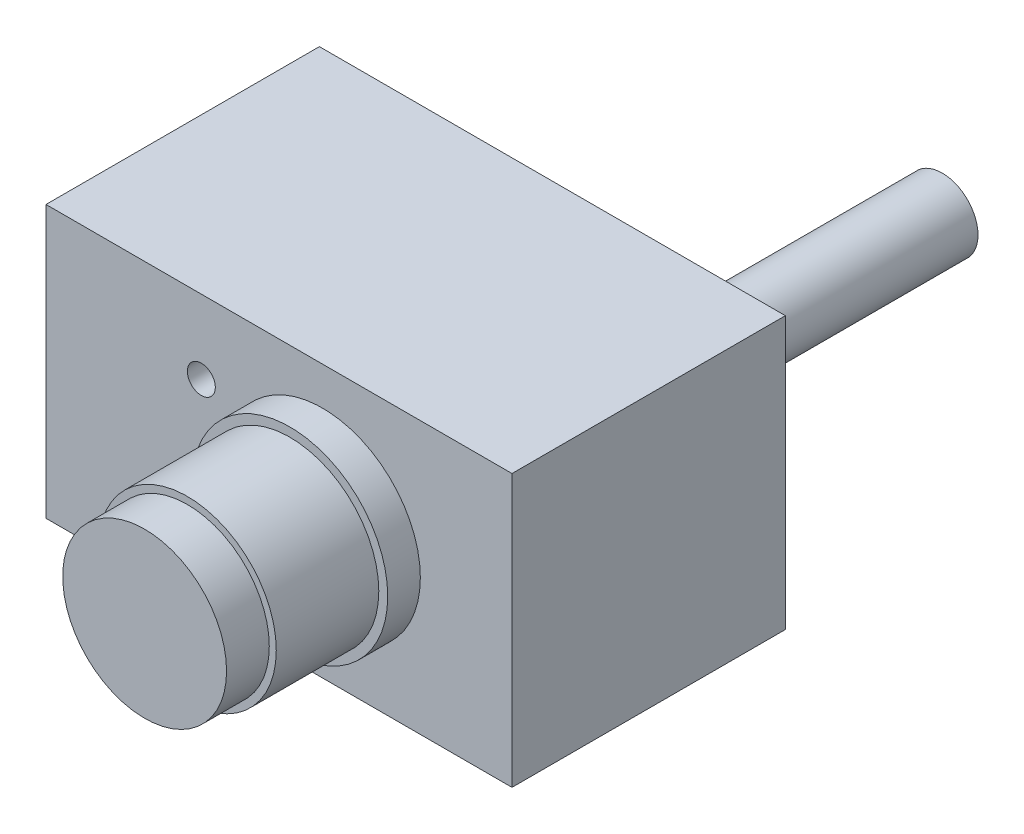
ISO-10303-21;
HEADER;
FILE_DESCRIPTION(('STEP AP214'),'2;1');
FILE_NAME('part.step','',(''),(''),'','','');
FILE_SCHEMA(('AUTOMOTIVE_DESIGN { 1 0 10303 214 1 1 1 1 }'));
ENDSEC;
DATA;
#1=APPLICATION_CONTEXT('core data for automotive mechanical design processes');
#2=APPLICATION_PROTOCOL_DEFINITION('international standard','automotive_design',2000,#1);
#3=PRODUCT_CONTEXT('',#1,'mechanical');
#4=PRODUCT('Part','Part','',(#3));
#5=PRODUCT_RELATED_PRODUCT_CATEGORY('part','',(#4));
#6=PRODUCT_DEFINITION_FORMATION('','',#4);
#7=PRODUCT_DEFINITION_CONTEXT('part definition',#1,'design');
#8=PRODUCT_DEFINITION('design','',#6,#7);
#9=PRODUCT_DEFINITION_SHAPE('','',#8);
#10=(LENGTH_UNIT() NAMED_UNIT(*) SI_UNIT(.MILLI.,.METRE.));
#11=(NAMED_UNIT(*) PLANE_ANGLE_UNIT() SI_UNIT($,.RADIAN.));
#12=(NAMED_UNIT(*) SI_UNIT($,.STERADIAN.) SOLID_ANGLE_UNIT());
#13=UNCERTAINTY_MEASURE_WITH_UNIT(LENGTH_MEASURE(1.E-05),#10,'distance_accuracy_value','');
#14=(GEOMETRIC_REPRESENTATION_CONTEXT(3) GLOBAL_UNCERTAINTY_ASSIGNED_CONTEXT((#13)) GLOBAL_UNIT_ASSIGNED_CONTEXT((#10,
#11,#12)) REPRESENTATION_CONTEXT('',''));
#15=CARTESIAN_POINT('',(0.,0.,0.));
#16=DIRECTION('',(0.,0.,1.));
#17=DIRECTION('',(1.,0.,0.));
#18=AXIS2_PLACEMENT_3D('',#15,#16,#17);
#19=CARTESIAN_POINT('',(76.1999999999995,44.45,-44.704));
#20=DIRECTION('',(0.,0.,1.));
#21=DIRECTION('',(0.999999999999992,0.,0.));
#22=AXIS2_PLACEMENT_3D('',#19,#20,#21);
#23=PLANE('',#22);
#24=CARTESIAN_POINT('',(66.2939999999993,22.225,-44.704));
#25=DIRECTION('',(0.,0.,1.));
#26=DIRECTION('',(0.999999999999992,0.,0.));
#27=AXIS2_PLACEMENT_3D('',#24,#25,#26);
#28=CIRCLE('',#27,6.35000000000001);
#29=CARTESIAN_POINT('',(72.6439999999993,22.225,-44.704));
#30=VERTEX_POINT('',#29);
#31=EDGE_CURVE('E51',#30,#30,#28,.F.);
#32=ORIENTED_EDGE('',*,*,#31,.F.);
#33=EDGE_LOOP('',(#32));
#34=FACE_BOUND('',#33,.T.);
#35=DIRECTION('',(-0.999999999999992,0.,0.));
#36=VECTOR('',#35,1.);
#37=CARTESIAN_POINT('',(76.1999999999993,-2.91433543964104E-13,-44.7039999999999));
#38=LINE('',#37,#36);
#39=CARTESIAN_POINT('',(76.1999999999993,-2.91433543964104E-13,-44.7039999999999));
#40=VERTEX_POINT('',#39);
#41=CARTESIAN_POINT('',(0.,0.,-44.704));
#42=VERTEX_POINT('',#41);
#43=EDGE_CURVE('E223',#40,#42,#38,.T.);
#44=ORIENTED_EDGE('',*,*,#43,.T.);
#45=DIRECTION('',(0.,-1.,0.));
#46=VECTOR('',#45,1.);
#47=CARTESIAN_POINT('',(0.,44.45,-44.704));
#48=LINE('',#47,#46);
#49=CARTESIAN_POINT('',(0.,44.45,-44.704));
#50=VERTEX_POINT('',#49);
#51=EDGE_CURVE('E241',#50,#42,#48,.T.);
#52=ORIENTED_EDGE('',*,*,#51,.F.);
#53=DIRECTION('',(-0.999999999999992,0.,0.));
#54=VECTOR('',#53,1.);
#55=CARTESIAN_POINT('',(76.1999999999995,44.45,-44.704));
#56=LINE('',#55,#54);
#57=CARTESIAN_POINT('',(76.1999999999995,44.45,-44.704));
#58=VERTEX_POINT('',#57);
#59=EDGE_CURVE('E234',#58,#50,#56,.T.);
#60=ORIENTED_EDGE('',*,*,#59,.F.);
#61=DIRECTION('',(0.,-1.,0.));
#62=VECTOR('',#61,1.);
#63=CARTESIAN_POINT('',(76.1999999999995,44.45,-44.704));
#64=LINE('',#63,#62);
#65=EDGE_CURVE('E246',#58,#40,#64,.T.);
#66=ORIENTED_EDGE('',*,*,#65,.T.);
#67=EDGE_LOOP('',(#44,#52,#60,#66));
#68=FACE_BOUND('',#67,.T.);
#69=CARTESIAN_POINT('',(47.6053082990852,30.4546,-44.704));
#70=DIRECTION('',(0.,0.,-1.));
#71=DIRECTION('',(-0.999999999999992,0.,0.));
#72=AXIS2_PLACEMENT_3D('',#69,#70,#71);
#73=CIRCLE('',#72,3.175);
#74=CARTESIAN_POINT('',(50.7682264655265,30.7313194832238,-44.704));
#75=VERTEX_POINT('',#74);
#76=CARTESIAN_POINT('',(47.6053082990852,27.2795999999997,-44.7039999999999));
#77=VERTEX_POINT('',#76);
#78=EDGE_CURVE('E150',#75,#77,#73,.T.);
#79=ORIENTED_EDGE('',*,*,#78,.F.);
#80=DIRECTION('',(-0.0871557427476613,0.996194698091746,0.));
#81=VECTOR('',#80,1.);
#82=CARTESIAN_POINT('',(50.7682264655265,30.7313194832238,-44.704));
#83=LINE('',#82,#81);
#84=CARTESIAN_POINT('',(50.4437835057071,34.4397194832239,-44.7039999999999));
#85=VERTEX_POINT('',#84);
#86=EDGE_CURVE('E173',#75,#85,#83,.T.);
#87=ORIENTED_EDGE('',*,*,#86,.T.);
#88=CARTESIAN_POINT('',(47.2808653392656,34.163,-44.704));
#89=DIRECTION('',(0.,0.,-1.));
#90=DIRECTION('',(-0.999999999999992,0.,0.));
#91=AXIS2_PLACEMENT_3D('',#88,#89,#90);
#92=CIRCLE('',#91,3.175);
#93=CARTESIAN_POINT('',(47.2808653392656,37.338,-44.704));
#94=VERTEX_POINT('',#93);
#95=EDGE_CURVE('E58',#94,#85,#92,.T.);
#96=ORIENTED_EDGE('',*,*,#95,.F.);
#97=DIRECTION('',(0.999999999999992,0.,0.));
#98=VECTOR('',#97,1.);
#99=CARTESIAN_POINT('',(14.6315875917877,37.338,-44.704));
#100=LINE('',#99,#98);
#101=CARTESIAN_POINT('',(14.6315875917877,37.338,-44.704));
#102=VERTEX_POINT('',#101);
#103=EDGE_CURVE('E170',#102,#94,#100,.T.);
#104=ORIENTED_EDGE('',*,*,#103,.F.);
#105=CARTESIAN_POINT('',(14.6315875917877,34.163,-44.704));
#106=DIRECTION('',(0.,0.,-1.));
#107=DIRECTION('',(-0.999999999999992,0.,0.));
#108=AXIS2_PLACEMENT_3D('',#105,#106,#107);
#109=CIRCLE('',#108,3.175);
#110=CARTESIAN_POINT('',(11.4686694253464,34.4397194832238,-44.704));
#111=VERTEX_POINT('',#110);
#112=EDGE_CURVE('E168',#111,#102,#109,.T.);
#113=ORIENTED_EDGE('',*,*,#112,.F.);
#114=DIRECTION('',(-0.0871557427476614,-0.996194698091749,0.));
#115=VECTOR('',#114,1.);
#116=CARTESIAN_POINT('',(11.4686694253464,34.4397194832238,-44.704));
#117=LINE('',#116,#115);
#118=CARTESIAN_POINT('',(11.1442264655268,30.7313194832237,-44.7039999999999));
#119=VERTEX_POINT('',#118);
#120=EDGE_CURVE('E163',#111,#119,#117,.T.);
#121=ORIENTED_EDGE('',*,*,#120,.T.);
#122=CARTESIAN_POINT('',(14.3071446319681,30.4545999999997,-44.7039999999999));
#123=DIRECTION('',(0.,0.,1.));
#124=DIRECTION('',(0.999999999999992,0.,0.));
#125=AXIS2_PLACEMENT_3D('',#122,#123,#124);
#126=CIRCLE('',#125,3.175);
#127=CARTESIAN_POINT('',(14.3071446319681,27.2796,-44.704));
#128=VERTEX_POINT('',#127);
#129=EDGE_CURVE('E161',#119,#128,#126,.T.);
#130=ORIENTED_EDGE('',*,*,#129,.T.);
#131=DIRECTION('',(-0.999999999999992,0.,0.));
#132=VECTOR('',#131,1.);
#133=CARTESIAN_POINT('',(47.6053082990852,27.2795999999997,-44.7039999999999));
#134=LINE('',#133,#132);
#135=EDGE_CURVE('E140',#77,#128,#134,.T.);
#136=ORIENTED_EDGE('',*,*,#135,.F.);
#137=EDGE_LOOP('',(#79,#87,#96,#104,#113,#121,#130,#136));
#138=FACE_BOUND('',#137,.T.);
#139=CARTESIAN_POINT('',(66.2939999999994,36.0679999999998,-44.7039999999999));
#140=DIRECTION('',(0.,0.,1.));
#141=DIRECTION('',(0.999999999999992,0.,0.));
#142=AXIS2_PLACEMENT_3D('',#139,#140,#141);
#143=CIRCLE('',#142,5.84200000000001);
#144=CARTESIAN_POINT('',(72.1359999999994,36.0679999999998,-44.7039999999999));
#145=VERTEX_POINT('',#144);
#146=EDGE_CURVE('E13',#145,#145,#143,.F.);
#147=ORIENTED_EDGE('',*,*,#146,.F.);
#148=EDGE_LOOP('',(#147));
#149=FACE_BOUND('',#148,.T.);
#150=ADVANCED_FACE('F43',(#34,#68,#138,#149),#23,.F.);
#151=CARTESIAN_POINT('',(45.2119999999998,22.225,22.098));
#152=DIRECTION('',(0.,0.,1.));
#153=DIRECTION('',(0.999999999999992,0.,0.));
#154=AXIS2_PLACEMENT_3D('',#151,#152,#153);
#155=PLANE('',#154);
#156=CARTESIAN_POINT('',(45.2119999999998,22.225,22.098));
#157=DIRECTION('',(0.,0.,1.));
#158=DIRECTION('',(0.999999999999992,0.,0.));
#159=AXIS2_PLACEMENT_3D('',#156,#157,#158);
#160=CIRCLE('',#159,14.5415);
#161=CARTESIAN_POINT('',(59.7534999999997,22.225,22.098));
#162=VERTEX_POINT('',#161);
#163=EDGE_CURVE('E214',#162,#162,#160,.T.);
#164=ORIENTED_EDGE('',*,*,#163,.T.);
#165=EDGE_LOOP('',(#164));
#166=FACE_BOUND('',#165,.T.);
#167=CARTESIAN_POINT('',(45.2119999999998,22.225,22.098));
#168=DIRECTION('',(0.,0.,1.));
#169=DIRECTION('',(0.999999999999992,0.,0.));
#170=AXIS2_PLACEMENT_3D('',#167,#168,#169);
#171=CIRCLE('',#170,13.3985);
#172=CARTESIAN_POINT('',(58.6104999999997,22.225,22.098));
#173=VERTEX_POINT('',#172);
#174=EDGE_CURVE('E146',#173,#173,#171,.T.);
#175=ORIENTED_EDGE('',*,*,#174,.F.);
#176=EDGE_LOOP('',(#175));
#177=FACE_BOUND('',#176,.T.);
#178=ADVANCED_FACE('F257',(#166,#177),#155,.T.);
#179=CARTESIAN_POINT('',(45.2119999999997,22.2249999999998,5.33400000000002));
#180=DIRECTION('',(0.,0.,1.));
#181=DIRECTION('',(0.999999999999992,0.,0.));
#182=AXIS2_PLACEMENT_3D('',#179,#180,#181);
#183=PLANE('',#182);
#184=CARTESIAN_POINT('',(45.2119999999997,22.2249999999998,5.33400000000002));
#185=DIRECTION('',(0.,0.,1.));
#186=DIRECTION('',(0.999999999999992,0.,0.));
#187=AXIS2_PLACEMENT_3D('',#184,#185,#186);
#188=CIRCLE('',#187,16.002);
#189=CARTESIAN_POINT('',(61.2139999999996,22.2249999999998,5.33400000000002));
#190=VERTEX_POINT('',#189);
#191=EDGE_CURVE('E217',#190,#190,#188,.T.);
#192=ORIENTED_EDGE('',*,*,#191,.T.);
#193=EDGE_LOOP('',(#192));
#194=FACE_BOUND('',#193,.T.);
#195=CARTESIAN_POINT('',(45.2119999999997,22.2249999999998,5.33400000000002));
#196=DIRECTION('',(0.,0.,1.));
#197=DIRECTION('',(0.999999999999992,0.,0.));
#198=AXIS2_PLACEMENT_3D('',#195,#196,#197);
#199=CIRCLE('',#198,14.5415);
#200=CARTESIAN_POINT('',(59.7534999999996,22.2249999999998,5.33400000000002));
#201=VERTEX_POINT('',#200);
#202=EDGE_CURVE('E211',#201,#201,#199,.T.);
#203=ORIENTED_EDGE('',*,*,#202,.F.);
#204=EDGE_LOOP('',(#203));
#205=FACE_BOUND('',#204,.T.);
#206=ADVANCED_FACE('F276',(#194,#205),#183,.T.);
#207=CARTESIAN_POINT('',(0.,44.45,0.));
#208=DIRECTION('',(0.,0.,-1.));
#209=DIRECTION('',(-0.999999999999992,0.,0.));
#210=AXIS2_PLACEMENT_3D('',#207,#208,#209);
#211=PLANE('',#210);
#212=CARTESIAN_POINT('',(25.3999999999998,32.385,0.));
#213=DIRECTION('',(0.,0.,1.));
#214=DIRECTION('',(0.999999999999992,0.,0.));
#215=AXIS2_PLACEMENT_3D('',#212,#213,#214);
#216=CIRCLE('',#215,2.286);
#217=CARTESIAN_POINT('',(27.6859999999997,32.385,0.));
#218=VERTEX_POINT('',#217);
#219=EDGE_CURVE('E507',#218,#218,#216,.T.);
#220=ORIENTED_EDGE('',*,*,#219,.F.);
#221=EDGE_LOOP('',(#220));
#222=FACE_BOUND('',#221,.T.);
#223=CARTESIAN_POINT('',(25.3999999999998,12.0649999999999,0.));
#224=DIRECTION('',(0.,0.,1.));
#225=DIRECTION('',(0.999999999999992,0.,0.));
#226=AXIS2_PLACEMENT_3D('',#223,#224,#225);
#227=CIRCLE('',#226,2.286);
#228=CARTESIAN_POINT('',(27.6859999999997,12.0649999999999,0.));
#229=VERTEX_POINT('',#228);
#230=EDGE_CURVE('E501',#229,#229,#227,.T.);
#231=ORIENTED_EDGE('',*,*,#230,.F.);
#232=EDGE_LOOP('',(#231));
#233=FACE_BOUND('',#232,.T.);
#234=DIRECTION('',(0.999999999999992,0.,0.));
#235=VECTOR('',#234,1.);
#236=CARTESIAN_POINT('',(0.,0.,0.));
#237=LINE('',#236,#235);
#238=CARTESIAN_POINT('',(0.,0.,0.));
#239=VERTEX_POINT('',#238);
#240=CARTESIAN_POINT('',(76.1999999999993,0.,0.));
#241=VERTEX_POINT('',#240);
#242=EDGE_CURVE('E229',#239,#241,#237,.T.);
#243=ORIENTED_EDGE('',*,*,#242,.T.);
#244=DIRECTION('',(0.,-1.,0.));
#245=VECTOR('',#244,1.);
#246=CARTESIAN_POINT('',(76.1999999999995,44.45,0.));
#247=LINE('',#246,#245);
#248=CARTESIAN_POINT('',(76.1999999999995,44.45,0.));
#249=VERTEX_POINT('',#248);
#250=EDGE_CURVE('E244',#249,#241,#247,.T.);
#251=ORIENTED_EDGE('',*,*,#250,.F.);
#252=DIRECTION('',(0.999999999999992,0.,0.));
#253=VECTOR('',#252,1.);
#254=CARTESIAN_POINT('',(0.,44.45,0.));
#255=LINE('',#254,#253);
#256=CARTESIAN_POINT('',(0.,44.45,0.));
#257=VERTEX_POINT('',#256);
#258=EDGE_CURVE('E239',#257,#249,#255,.T.);
#259=ORIENTED_EDGE('',*,*,#258,.F.);
#260=DIRECTION('',(0.,-1.,0.));
#261=VECTOR('',#260,1.);
#262=CARTESIAN_POINT('',(0.,44.45,0.));
#263=LINE('',#262,#261);
#264=EDGE_CURVE('E66',#257,#239,#263,.T.);
#265=ORIENTED_EDGE('',*,*,#264,.T.);
#266=EDGE_LOOP('',(#243,#251,#259,#265));
#267=FACE_BOUND('',#266,.T.);
#268=CARTESIAN_POINT('',(45.2119999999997,22.2249999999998,0.));
#269=DIRECTION('',(0.,0.,-1.));
#270=DIRECTION('',(-0.999999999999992,0.,0.));
#271=AXIS2_PLACEMENT_3D('',#268,#269,#270);
#272=CIRCLE('',#271,16.002);
#273=CARTESIAN_POINT('',(29.2099999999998,22.2249999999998,0.));
#274=VERTEX_POINT('',#273);
#275=EDGE_CURVE('E243',#274,#274,#272,.F.);
#276=ORIENTED_EDGE('',*,*,#275,.F.);
#277=EDGE_LOOP('',(#276));
#278=FACE_BOUND('',#277,.T.);
#279=ADVANCED_FACE('F273',(#222,#233,#267,#278),#211,.F.);
#280=CARTESIAN_POINT('',(0.,44.45,0.));
#281=DIRECTION('',(-0.999999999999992,0.,0.));
#282=DIRECTION('',(0.,0.,1.));
#283=AXIS2_PLACEMENT_3D('',#280,#281,#282);
#284=PLANE('',#283);
#285=DIRECTION('',(0.,0.,-1.));
#286=VECTOR('',#285,1.);
#287=CARTESIAN_POINT('',(0.,0.,0.));
#288=LINE('',#287,#286);
#289=EDGE_CURVE('E220',#239,#42,#288,.T.);
#290=ORIENTED_EDGE('',*,*,#289,.F.);
#291=ORIENTED_EDGE('',*,*,#264,.F.);
#292=DIRECTION('',(0.,0.,-1.));
#293=VECTOR('',#292,1.);
#294=CARTESIAN_POINT('',(0.,44.45,0.));
#295=LINE('',#294,#293);
#296=EDGE_CURVE('E232',#257,#50,#295,.T.);
#297=ORIENTED_EDGE('',*,*,#296,.T.);
#298=ORIENTED_EDGE('',*,*,#51,.T.);
#299=EDGE_LOOP('',(#290,#291,#297,#298));
#300=FACE_BOUND('',#299,.T.);
#301=ADVANCED_FACE('F45',(#300),#284,.T.);
#302=CARTESIAN_POINT('',(76.1999999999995,44.45,-44.704));
#303=DIRECTION('',(0.999999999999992,0.,0.));
#304=DIRECTION('',(0.,0.,-1.));
#305=AXIS2_PLACEMENT_3D('',#302,#303,#304);
#306=PLANE('',#305);
#307=DIRECTION('',(0.,0.,1.));
#308=VECTOR('',#307,1.);
#309=CARTESIAN_POINT('',(76.1999999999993,-2.91433543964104E-13,-44.7039999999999));
#310=LINE('',#309,#308);
#311=EDGE_CURVE('E226',#40,#241,#310,.T.);
#312=ORIENTED_EDGE('',*,*,#311,.F.);
#313=ORIENTED_EDGE('',*,*,#65,.F.);
#314=DIRECTION('',(0.,0.,1.));
#315=VECTOR('',#314,1.);
#316=CARTESIAN_POINT('',(76.1999999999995,44.45,-44.704));
#317=LINE('',#316,#315);
#318=EDGE_CURVE('E236',#58,#249,#317,.T.);
#319=ORIENTED_EDGE('',*,*,#318,.T.);
#320=ORIENTED_EDGE('',*,*,#250,.T.);
#321=EDGE_LOOP('',(#312,#313,#319,#320));
#322=FACE_BOUND('',#321,.T.);
#323=ADVANCED_FACE('F271',(#322),#306,.T.);
#324=CARTESIAN_POINT('',(0.,44.45,0.));
#325=DIRECTION('',(0.,-1.,0.));
#326=DIRECTION('',(0.,0.,-1.));
#327=AXIS2_PLACEMENT_3D('',#324,#325,#326);
#328=PLANE('',#327);
#329=ORIENTED_EDGE('',*,*,#296,.F.);
#330=ORIENTED_EDGE('',*,*,#258,.T.);
#331=ORIENTED_EDGE('',*,*,#318,.F.);
#332=ORIENTED_EDGE('',*,*,#59,.T.);
#333=EDGE_LOOP('',(#329,#330,#331,#332));
#334=FACE_BOUND('',#333,.T.);
#335=ADVANCED_FACE('F267',(#334),#328,.F.);
#336=CARTESIAN_POINT('',(0.,0.,0.));
#337=DIRECTION('',(0.,-1.,0.));
#338=DIRECTION('',(0.,0.,-1.));
#339=AXIS2_PLACEMENT_3D('',#336,#337,#338);
#340=PLANE('',#339);
#341=ORIENTED_EDGE('',*,*,#289,.T.);
#342=ORIENTED_EDGE('',*,*,#43,.F.);
#343=ORIENTED_EDGE('',*,*,#311,.T.);
#344=ORIENTED_EDGE('',*,*,#242,.F.);
#345=EDGE_LOOP('',(#341,#342,#343,#344));
#346=FACE_BOUND('',#345,.T.);
#347=ADVANCED_FACE('F264',(#346),#340,.T.);
#348=CARTESIAN_POINT('',(45.2119999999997,22.2249999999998,5.33400000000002));
#349=DIRECTION('',(0.,0.,-1.));
#350=DIRECTION('',(-0.999999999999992,0.,0.));
#351=AXIS2_PLACEMENT_3D('',#348,#349,#350);
#352=CYLINDRICAL_SURFACE('',#351,16.002);
#353=ORIENTED_EDGE('',*,*,#191,.F.);
#354=EDGE_LOOP('',(#353));
#355=FACE_BOUND('',#354,.T.);
#356=ORIENTED_EDGE('',*,*,#275,.T.);
#357=EDGE_LOOP('',(#356));
#358=FACE_BOUND('',#357,.T.);
#359=ADVANCED_FACE('F281',(#355,#358),#352,.T.);
#360=CARTESIAN_POINT('',(45.2119999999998,22.225,22.098));
#361=DIRECTION('',(0.,0.,-1.));
#362=DIRECTION('',(-0.999999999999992,0.,0.));
#363=AXIS2_PLACEMENT_3D('',#360,#361,#362);
#364=CYLINDRICAL_SURFACE('',#363,14.5415);
#365=ORIENTED_EDGE('',*,*,#163,.F.);
#366=EDGE_LOOP('',(#365));
#367=FACE_BOUND('',#366,.T.);
#368=ORIENTED_EDGE('',*,*,#202,.T.);
#369=EDGE_LOOP('',(#368));
#370=FACE_BOUND('',#369,.T.);
#371=ADVANCED_FACE('F283',(#367,#370),#364,.T.);
#372=CARTESIAN_POINT('',(45.2119999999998,22.2249999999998,29.083));
#373=DIRECTION('',(0.,0.,-1.));
#374=DIRECTION('',(-0.999999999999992,0.,0.));
#375=AXIS2_PLACEMENT_3D('',#372,#373,#374);
#376=CYLINDRICAL_SURFACE('',#375,13.3985);
#377=CARTESIAN_POINT('',(45.2119999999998,22.2249999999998,29.083));
#378=DIRECTION('',(0.,0.,1.));
#379=DIRECTION('',(0.999999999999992,0.,0.));
#380=AXIS2_PLACEMENT_3D('',#377,#378,#379);
#381=CIRCLE('',#380,13.3985);
#382=CARTESIAN_POINT('',(58.6104999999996,22.2249999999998,29.083));
#383=VERTEX_POINT('',#382);
#384=EDGE_CURVE('E208',#383,#383,#381,.T.);
#385=ORIENTED_EDGE('',*,*,#384,.F.);
#386=EDGE_LOOP('',(#385));
#387=FACE_BOUND('',#386,.T.);
#388=ORIENTED_EDGE('',*,*,#174,.T.);
#389=EDGE_LOOP('',(#388));
#390=FACE_BOUND('',#389,.T.);
#391=ADVANCED_FACE('F290',(#387,#390),#376,.T.);
#392=CARTESIAN_POINT('',(45.2119999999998,22.2249999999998,29.083));
#393=DIRECTION('',(0.,0.,1.));
#394=DIRECTION('',(0.999999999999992,0.,0.));
#395=AXIS2_PLACEMENT_3D('',#392,#393,#394);
#396=PLANE('',#395);
#397=ORIENTED_EDGE('',*,*,#384,.T.);
#398=EDGE_LOOP('',(#397));
#399=FACE_BOUND('',#398,.T.);
#400=ADVANCED_FACE('F423',(#399),#396,.T.);
#401=CARTESIAN_POINT('',(47.6053082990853,30.4545999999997,-47.6249999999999));
#402=DIRECTION('',(0.,0.,1.));
#403=DIRECTION('',(0.999999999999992,0.,0.));
#404=AXIS2_PLACEMENT_3D('',#401,#402,#403);
#405=CYLINDRICAL_SURFACE('',#404,3.175);
#406=ORIENTED_EDGE('',*,*,#78,.T.);
#407=DIRECTION('',(0.,0.,1.));
#408=VECTOR('',#407,1.);
#409=CARTESIAN_POINT('',(47.6053082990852,27.2795999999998,-47.6249999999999));
#410=LINE('',#409,#408);
#411=CARTESIAN_POINT('',(47.6053082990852,27.2795999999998,-47.6249999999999));
#412=VERTEX_POINT('',#411);
#413=EDGE_CURVE('E135',#412,#77,#410,.T.);
#414=ORIENTED_EDGE('',*,*,#413,.F.);
#415=CARTESIAN_POINT('',(47.6053082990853,30.4545999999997,-47.6249999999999));
#416=DIRECTION('',(0.,0.,-1.));
#417=DIRECTION('',(-0.999999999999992,0.,0.));
#418=AXIS2_PLACEMENT_3D('',#415,#416,#417);
#419=CIRCLE('',#418,3.175);
#420=CARTESIAN_POINT('',(50.7682264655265,30.7313194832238,-47.625));
#421=VERTEX_POINT('',#420);
#422=EDGE_CURVE('E175',#421,#412,#419,.T.);
#423=ORIENTED_EDGE('',*,*,#422,.F.);
#424=DIRECTION('',(0.,0.,1.));
#425=VECTOR('',#424,1.);
#426=CARTESIAN_POINT('',(50.7682264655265,30.7313194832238,-47.625));
#427=LINE('',#426,#425);
#428=EDGE_CURVE('E152',#421,#75,#427,.T.);
#429=ORIENTED_EDGE('',*,*,#428,.T.);
#430=EDGE_LOOP('',(#406,#414,#423,#429));
#431=FACE_BOUND('',#430,.T.);
#432=ADVANCED_FACE('F151',(#431),#405,.T.);
#433=CARTESIAN_POINT('',(47.6053082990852,27.2795999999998,-47.6249999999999));
#434=DIRECTION('',(0.,1.,0.));
#435=DIRECTION('',(0.,0.,1.));
#436=AXIS2_PLACEMENT_3D('',#433,#434,#435);
#437=PLANE('',#436);
#438=ORIENTED_EDGE('',*,*,#135,.T.);
#439=DIRECTION('',(0.,0.,1.));
#440=VECTOR('',#439,1.);
#441=CARTESIAN_POINT('',(14.3071446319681,27.2796,-47.625));
#442=LINE('',#441,#440);
#443=CARTESIAN_POINT('',(14.3071446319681,27.2796,-47.625));
#444=VERTEX_POINT('',#443);
#445=EDGE_CURVE('E147',#444,#128,#442,.T.);
#446=ORIENTED_EDGE('',*,*,#445,.F.);
#447=DIRECTION('',(-0.999999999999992,0.,0.));
#448=VECTOR('',#447,1.);
#449=CARTESIAN_POINT('',(47.6053082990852,27.2795999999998,-47.6249999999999));
#450=LINE('',#449,#448);
#451=EDGE_CURVE('E142',#412,#444,#450,.T.);
#452=ORIENTED_EDGE('',*,*,#451,.F.);
#453=ORIENTED_EDGE('',*,*,#413,.T.);
#454=EDGE_LOOP('',(#438,#446,#452,#453));
#455=FACE_BOUND('',#454,.T.);
#456=ADVANCED_FACE('F137',(#455),#437,.F.);
#457=CARTESIAN_POINT('',(14.3071446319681,30.4545999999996,-47.6249999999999));
#458=DIRECTION('',(0.,0.,1.));
#459=DIRECTION('',(0.999999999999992,0.,0.));
#460=AXIS2_PLACEMENT_3D('',#457,#458,#459);
#461=CYLINDRICAL_SURFACE('',#460,3.175);
#462=ORIENTED_EDGE('',*,*,#129,.F.);
#463=DIRECTION('',(0.,0.,1.));
#464=VECTOR('',#463,1.);
#465=CARTESIAN_POINT('',(11.1442264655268,30.7313194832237,-47.6249999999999));
#466=LINE('',#465,#464);
#467=CARTESIAN_POINT('',(11.1442264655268,30.7313194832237,-47.6249999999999));
#468=VERTEX_POINT('',#467);
#469=EDGE_CURVE('E203',#468,#119,#466,.T.);
#470=ORIENTED_EDGE('',*,*,#469,.F.);
#471=CARTESIAN_POINT('',(14.3071446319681,30.4545999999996,-47.6249999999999));
#472=DIRECTION('',(0.,0.,1.));
#473=DIRECTION('',(0.999999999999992,0.,0.));
#474=AXIS2_PLACEMENT_3D('',#471,#472,#473);
#475=CIRCLE('',#474,3.175);
#476=EDGE_CURVE('E178',#468,#444,#475,.T.);
#477=ORIENTED_EDGE('',*,*,#476,.T.);
#478=ORIENTED_EDGE('',*,*,#445,.T.);
#479=EDGE_LOOP('',(#462,#470,#477,#478));
#480=FACE_BOUND('',#479,.T.);
#481=ADVANCED_FACE('F414',(#480),#461,.T.);
#482=CARTESIAN_POINT('',(11.4686694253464,34.4397194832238,-47.625));
#483=DIRECTION('',(-0.996194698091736,0.0871557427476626,0.));
#484=DIRECTION('',(-0.0871557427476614,-0.996194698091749,0.));
#485=AXIS2_PLACEMENT_3D('',#482,#483,#484);
#486=PLANE('',#485);
#487=ORIENTED_EDGE('',*,*,#120,.F.);
#488=DIRECTION('',(0.,0.,1.));
#489=VECTOR('',#488,1.);
#490=CARTESIAN_POINT('',(11.4686694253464,34.4397194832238,-47.625));
#491=LINE('',#490,#489);
#492=CARTESIAN_POINT('',(11.4686694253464,34.4397194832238,-47.625));
#493=VERTEX_POINT('',#492);
#494=EDGE_CURVE('E201',#493,#111,#491,.T.);
#495=ORIENTED_EDGE('',*,*,#494,.F.);
#496=DIRECTION('',(-0.0871557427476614,-0.996194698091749,0.));
#497=VECTOR('',#496,1.);
#498=CARTESIAN_POINT('',(11.4686694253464,34.4397194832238,-47.625));
#499=LINE('',#498,#497);
#500=EDGE_CURVE('E181',#493,#468,#499,.T.);
#501=ORIENTED_EDGE('',*,*,#500,.T.);
#502=ORIENTED_EDGE('',*,*,#469,.T.);
#503=EDGE_LOOP('',(#487,#495,#501,#502));
#504=FACE_BOUND('',#503,.T.);
#505=ADVANCED_FACE('F410',(#504),#486,.T.);
#506=CARTESIAN_POINT('',(14.6315875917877,34.163,-47.625));
#507=DIRECTION('',(0.,0.,1.));
#508=DIRECTION('',(0.999999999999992,0.,0.));
#509=AXIS2_PLACEMENT_3D('',#506,#507,#508);
#510=CYLINDRICAL_SURFACE('',#509,3.175);
#511=ORIENTED_EDGE('',*,*,#112,.T.);
#512=DIRECTION('',(0.,0.,1.));
#513=VECTOR('',#512,1.);
#514=CARTESIAN_POINT('',(14.6315875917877,37.338,-47.625));
#515=LINE('',#514,#513);
#516=CARTESIAN_POINT('',(14.6315875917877,37.338,-47.625));
#517=VERTEX_POINT('',#516);
#518=EDGE_CURVE('E198',#517,#102,#515,.T.);
#519=ORIENTED_EDGE('',*,*,#518,.F.);
#520=CARTESIAN_POINT('',(14.6315875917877,34.163,-47.625));
#521=DIRECTION('',(0.,0.,-1.));
#522=DIRECTION('',(-0.999999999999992,0.,0.));
#523=AXIS2_PLACEMENT_3D('',#520,#521,#522);
#524=CIRCLE('',#523,3.175);
#525=EDGE_CURVE('E184',#493,#517,#524,.T.);
#526=ORIENTED_EDGE('',*,*,#525,.F.);
#527=ORIENTED_EDGE('',*,*,#494,.T.);
#528=EDGE_LOOP('',(#511,#519,#526,#527));
#529=FACE_BOUND('',#528,.T.);
#530=ADVANCED_FACE('F406',(#529),#510,.T.);
#531=CARTESIAN_POINT('',(14.6315875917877,37.338,-47.625));
#532=DIRECTION('',(0.,-1.,0.));
#533=DIRECTION('',(0.999999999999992,0.,0.));
#534=AXIS2_PLACEMENT_3D('',#531,#532,#533);
#535=PLANE('',#534);
#536=ORIENTED_EDGE('',*,*,#103,.T.);
#537=DIRECTION('',(0.,0.,1.));
#538=VECTOR('',#537,1.);
#539=CARTESIAN_POINT('',(47.2808653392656,37.338,-47.625));
#540=LINE('',#539,#538);
#541=CARTESIAN_POINT('',(47.2808653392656,37.338,-47.625));
#542=VERTEX_POINT('',#541);
#543=EDGE_CURVE('E196',#542,#94,#540,.T.);
#544=ORIENTED_EDGE('',*,*,#543,.F.);
#545=DIRECTION('',(0.999999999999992,0.,0.));
#546=VECTOR('',#545,1.);
#547=CARTESIAN_POINT('',(14.6315875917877,37.338,-47.625));
#548=LINE('',#547,#546);
#549=EDGE_CURVE('E186',#517,#542,#548,.T.);
#550=ORIENTED_EDGE('',*,*,#549,.F.);
#551=ORIENTED_EDGE('',*,*,#518,.T.);
#552=EDGE_LOOP('',(#536,#544,#550,#551));
#553=FACE_BOUND('',#552,.T.);
#554=ADVANCED_FACE('F403',(#553),#535,.F.);
#555=CARTESIAN_POINT('',(47.2808653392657,34.1629999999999,-47.625));
#556=DIRECTION('',(0.,0.,1.));
#557=DIRECTION('',(0.999999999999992,0.,0.));
#558=AXIS2_PLACEMENT_3D('',#555,#556,#557);
#559=CYLINDRICAL_SURFACE('',#558,3.175);
#560=ORIENTED_EDGE('',*,*,#95,.T.);
#561=DIRECTION('',(0.,0.,1.));
#562=VECTOR('',#561,1.);
#563=CARTESIAN_POINT('',(50.4437835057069,34.4397194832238,-47.625));
#564=LINE('',#563,#562);
#565=CARTESIAN_POINT('',(50.4437835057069,34.4397194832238,-47.625));
#566=VERTEX_POINT('',#565);
#567=EDGE_CURVE('E194',#566,#85,#564,.T.);
#568=ORIENTED_EDGE('',*,*,#567,.F.);
#569=CARTESIAN_POINT('',(47.2808653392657,34.1629999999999,-47.625));
#570=DIRECTION('',(0.,0.,-1.));
#571=DIRECTION('',(-0.999999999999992,0.,0.));
#572=AXIS2_PLACEMENT_3D('',#569,#570,#571);
#573=CIRCLE('',#572,3.175);
#574=EDGE_CURVE('E188',#542,#566,#573,.T.);
#575=ORIENTED_EDGE('',*,*,#574,.F.);
#576=ORIENTED_EDGE('',*,*,#543,.T.);
#577=EDGE_LOOP('',(#560,#568,#575,#576));
#578=FACE_BOUND('',#577,.T.);
#579=ADVANCED_FACE('F399',(#578),#559,.T.);
#580=CARTESIAN_POINT('',(50.7682264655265,30.7313194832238,-47.625));
#581=DIRECTION('',(0.996194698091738,0.0871557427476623,0.));
#582=DIRECTION('',(-0.0871557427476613,0.996194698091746,0.));
#583=AXIS2_PLACEMENT_3D('',#580,#581,#582);
#584=PLANE('',#583);
#585=ORIENTED_EDGE('',*,*,#86,.F.);
#586=ORIENTED_EDGE('',*,*,#428,.F.);
#587=DIRECTION('',(-0.0871557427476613,0.996194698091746,0.));
#588=VECTOR('',#587,1.);
#589=CARTESIAN_POINT('',(50.7682264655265,30.7313194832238,-47.625));
#590=LINE('',#589,#588);
#591=EDGE_CURVE('E190',#421,#566,#590,.T.);
#592=ORIENTED_EDGE('',*,*,#591,.T.);
#593=ORIENTED_EDGE('',*,*,#567,.T.);
#594=EDGE_LOOP('',(#585,#586,#592,#593));
#595=FACE_BOUND('',#594,.T.);
#596=ADVANCED_FACE('F395',(#595),#584,.T.);
#597=CARTESIAN_POINT('',(47.6053082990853,30.4545999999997,-47.6249999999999));
#598=DIRECTION('',(0.,0.,-1.));
#599=DIRECTION('',(-0.999999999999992,0.,0.));
#600=AXIS2_PLACEMENT_3D('',#597,#598,#599);
#601=PLANE('',#600);
#602=ORIENTED_EDGE('',*,*,#422,.T.);
#603=ORIENTED_EDGE('',*,*,#451,.T.);
#604=ORIENTED_EDGE('',*,*,#476,.F.);
#605=ORIENTED_EDGE('',*,*,#500,.F.);
#606=ORIENTED_EDGE('',*,*,#525,.T.);
#607=ORIENTED_EDGE('',*,*,#549,.T.);
#608=ORIENTED_EDGE('',*,*,#574,.T.);
#609=ORIENTED_EDGE('',*,*,#591,.F.);
#610=EDGE_LOOP('',(#602,#603,#604,#605,#606,#607,#608,#609));
#611=FACE_BOUND('',#610,.T.);
#612=ADVANCED_FACE('F391',(#611),#601,.T.);
#613=CARTESIAN_POINT('',(66.2939999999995,22.2249999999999,-47.244));
#614=DIRECTION('',(0.,0.,1.));
#615=DIRECTION('',(0.999999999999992,0.,0.));
#616=AXIS2_PLACEMENT_3D('',#613,#614,#615);
#617=CYLINDRICAL_SURFACE('',#616,6.35000000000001);
#618=CARTESIAN_POINT('',(66.2939999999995,22.2249999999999,-47.244));
#619=DIRECTION('',(0.,0.,-1.));
#620=DIRECTION('',(-0.999999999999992,0.,0.));
#621=AXIS2_PLACEMENT_3D('',#618,#619,#620);
#622=CIRCLE('',#621,6.35000000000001);
#623=CARTESIAN_POINT('',(59.9439999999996,22.2249999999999,-47.244));
#624=VERTEX_POINT('',#623);
#625=EDGE_CURVE('E156',#624,#624,#622,.T.);
#626=ORIENTED_EDGE('',*,*,#625,.F.);
#627=EDGE_LOOP('',(#626));
#628=FACE_BOUND('',#627,.T.);
#629=ORIENTED_EDGE('',*,*,#31,.T.);
#630=EDGE_LOOP('',(#629));
#631=FACE_BOUND('',#630,.T.);
#632=ADVANCED_FACE('F253',(#628,#631),#617,.T.);
#633=CARTESIAN_POINT('',(66.2939999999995,22.2249999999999,-47.244));
#634=DIRECTION('',(0.,0.,-1.));
#635=DIRECTION('',(-0.999999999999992,0.,0.));
#636=AXIS2_PLACEMENT_3D('',#633,#634,#635);
#637=PLANE('',#636);
#638=ORIENTED_EDGE('',*,*,#625,.T.);
#639=EDGE_LOOP('',(#638));
#640=FACE_BOUND('',#639,.T.);
#641=ADVANCED_FACE('F333',(#640),#637,.T.);
#642=CARTESIAN_POINT('',(66.2939999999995,36.0679999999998,-80.2639999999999));
#643=DIRECTION('',(0.,0.,1.));
#644=DIRECTION('',(0.999999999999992,0.,0.));
#645=AXIS2_PLACEMENT_3D('',#642,#643,#644);
#646=CYLINDRICAL_SURFACE('',#645,5.84200000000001);
#647=CARTESIAN_POINT('',(66.2939999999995,36.0679999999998,-80.2639999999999));
#648=DIRECTION('',(0.,0.,-1.));
#649=DIRECTION('',(-0.999999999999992,0.,0.));
#650=AXIS2_PLACEMENT_3D('',#647,#648,#649);
#651=CIRCLE('',#650,5.84200000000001);
#652=CARTESIAN_POINT('',(60.4519999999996,36.0679999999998,-80.2639999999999));
#653=VERTEX_POINT('',#652);
#654=EDGE_CURVE('E496',#653,#653,#651,.T.);
#655=ORIENTED_EDGE('',*,*,#654,.F.);
#656=EDGE_LOOP('',(#655));
#657=FACE_BOUND('',#656,.T.);
#658=ORIENTED_EDGE('',*,*,#146,.T.);
#659=EDGE_LOOP('',(#658));
#660=FACE_BOUND('',#659,.T.);
#661=ADVANCED_FACE('F338',(#657,#660),#646,.T.);
#662=CARTESIAN_POINT('',(66.2939999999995,36.0679999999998,-80.2639999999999));
#663=DIRECTION('',(0.,0.,-1.));
#664=DIRECTION('',(-0.999999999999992,0.,0.));
#665=AXIS2_PLACEMENT_3D('',#662,#663,#664);
#666=PLANE('',#665);
#667=ORIENTED_EDGE('',*,*,#654,.T.);
#668=EDGE_LOOP('',(#667));
#669=FACE_BOUND('',#668,.T.);
#670=ADVANCED_FACE('F343',(#669),#666,.T.);
#671=CARTESIAN_POINT('',(25.3999999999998,12.065,-12.7));
#672=DIRECTION('',(0.,0.,1.));
#673=DIRECTION('',(0.999999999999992,0.,0.));
#674=AXIS2_PLACEMENT_3D('',#671,#672,#673);
#675=CYLINDRICAL_SURFACE('',#674,2.286);
#676=CARTESIAN_POINT('',(25.3999999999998,12.065,-12.7));
#677=DIRECTION('',(0.,0.,1.));
#678=DIRECTION('',(0.999999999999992,0.,0.));
#679=AXIS2_PLACEMENT_3D('',#676,#677,#678);
#680=CIRCLE('',#679,2.286);
#681=CARTESIAN_POINT('',(27.6859999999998,12.065,-12.7));
#682=VERTEX_POINT('',#681);
#683=EDGE_CURVE('E498',#682,#682,#680,.T.);
#684=ORIENTED_EDGE('',*,*,#683,.F.);
#685=EDGE_LOOP('',(#684));
#686=FACE_BOUND('',#685,.T.);
#687=ORIENTED_EDGE('',*,*,#230,.T.);
#688=EDGE_LOOP('',(#687));
#689=FACE_BOUND('',#688,.T.);
#690=ADVANCED_FACE('F351',(#686,#689),#675,.F.);
#691=CARTESIAN_POINT('',(25.3999999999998,12.065,-12.7));
#692=DIRECTION('',(0.,0.,1.));
#693=DIRECTION('',(0.999999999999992,0.,0.));
#694=AXIS2_PLACEMENT_3D('',#691,#692,#693);
#695=PLANE('',#694);
#696=ORIENTED_EDGE('',*,*,#683,.T.);
#697=EDGE_LOOP('',(#696));
#698=FACE_BOUND('',#697,.T.);
#699=ADVANCED_FACE('F359',(#698),#695,.T.);
#700=CARTESIAN_POINT('',(25.3999999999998,32.385,-12.7));
#701=DIRECTION('',(0.,0.,1.));
#702=DIRECTION('',(0.999999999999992,0.,0.));
#703=AXIS2_PLACEMENT_3D('',#700,#701,#702);
#704=CYLINDRICAL_SURFACE('',#703,2.286);
#705=CARTESIAN_POINT('',(25.3999999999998,32.385,-12.7));
#706=DIRECTION('',(0.,0.,1.));
#707=DIRECTION('',(0.999999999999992,0.,0.));
#708=AXIS2_PLACEMENT_3D('',#705,#706,#707);
#709=CIRCLE('',#708,2.286);
#710=CARTESIAN_POINT('',(27.6859999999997,32.385,-12.7));
#711=VERTEX_POINT('',#710);
#712=EDGE_CURVE('E504',#711,#711,#709,.T.);
#713=ORIENTED_EDGE('',*,*,#712,.F.);
#714=EDGE_LOOP('',(#713));
#715=FACE_BOUND('',#714,.T.);
#716=ORIENTED_EDGE('',*,*,#219,.T.);
#717=EDGE_LOOP('',(#716));
#718=FACE_BOUND('',#717,.T.);
#719=ADVANCED_FACE('F367',(#715,#718),#704,.F.);
#720=CARTESIAN_POINT('',(25.3999999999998,32.385,-12.7));
#721=DIRECTION('',(0.,0.,1.));
#722=DIRECTION('',(0.999999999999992,0.,0.));
#723=AXIS2_PLACEMENT_3D('',#720,#721,#722);
#724=PLANE('',#723);
#725=ORIENTED_EDGE('',*,*,#712,.T.);
#726=EDGE_LOOP('',(#725));
#727=FACE_BOUND('',#726,.T.);
#728=ADVANCED_FACE('F375',(#727),#724,.T.);
#729=CLOSED_SHELL('',(#150,#178,#206,#279,#301,#323,#335,#347,#359,#371,#391,#400,#432,#456,
#481,#505,#530,#554,#579,#596,#612,#632,#641,#661,#670,#690,#699,#719,#728));
#730=MANIFOLD_SOLID_BREP('B2',#729);
#731=ADVANCED_BREP_SHAPE_REPRESENTATION('',(#18,#730),#14);
#732=SHAPE_DEFINITION_REPRESENTATION(#9,#731);
ENDSEC;
END-ISO-10303-21;
